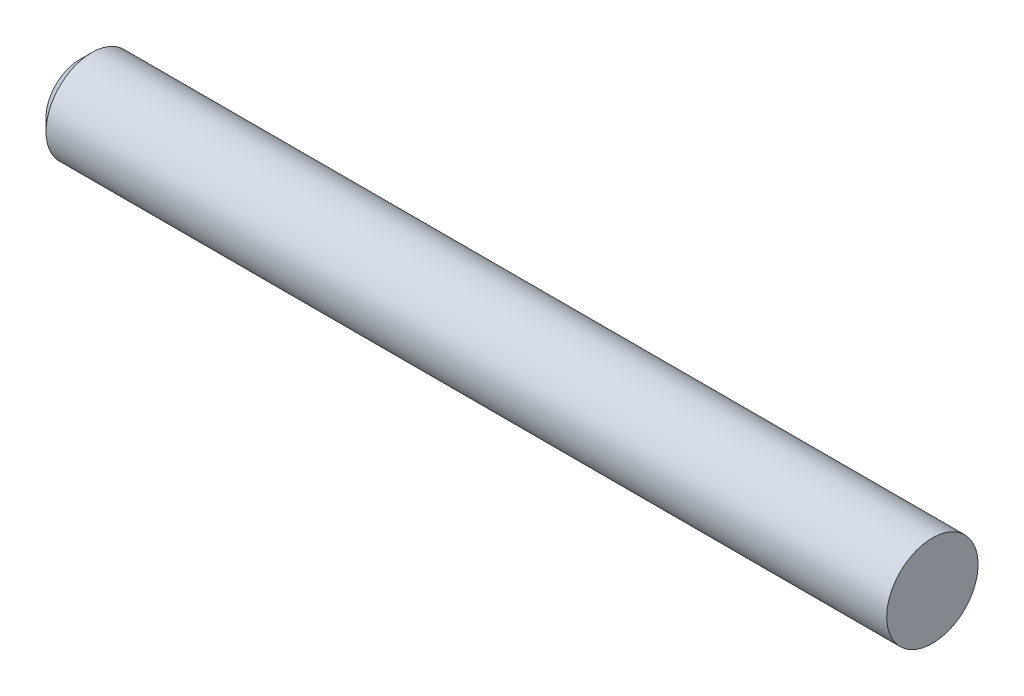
from build123d import *

# Parameters (mm, degrees)
SKETCH1_W     = 355.6
SKETCH1_H     = 19.05
CHAMFER1_SIZE = 5.08


with BuildPart() as part:
    # Sketch1 → Revolve1 (revolve)
    with BuildSketch(Plane(origin=(0, 0, 0), x_dir=(1, 0, 0), z_dir=(0, 1, 0)), mode=Mode.PRIVATE) as revolve1_sk:
        with Locations((177.8, 9.525)):
            Rectangle(SKETCH1_W, SKETCH1_H)
    revolve(revolve1_sk.sketch.rotate(Axis((0, 0, 0), (1, 0, 0)), 180), axis=Axis((0, 0, 0), (1, 0, 0)))

    # Chamfer1
    chamfer1_edges = [part.edges().sort_by_distance(p)[0] for p in [
        (0, 0, -19.05),
    ]]
    chamfer(chamfer1_edges, length=CHAMFER1_SIZE)


solid = part.part
